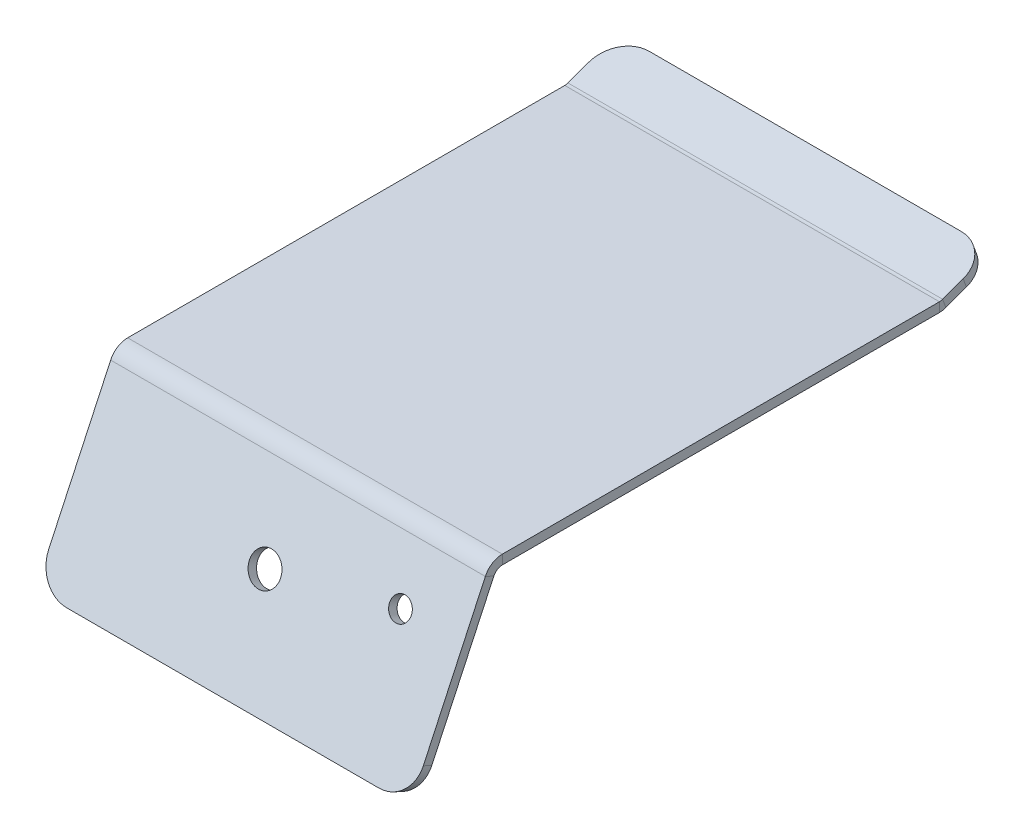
ISO-10303-21;
HEADER;
FILE_DESCRIPTION(('STEP AP214'),'2;1');
FILE_NAME('part.step','',(''),(''),'','','');
FILE_SCHEMA(('AUTOMOTIVE_DESIGN { 1 0 10303 214 1 1 1 1 }'));
ENDSEC;
DATA;
#1=APPLICATION_CONTEXT('core data for automotive mechanical design processes');
#2=APPLICATION_PROTOCOL_DEFINITION('international standard','automotive_design',2000,#1);
#3=PRODUCT_CONTEXT('',#1,'mechanical');
#4=PRODUCT('Part','Part','',(#3));
#5=PRODUCT_RELATED_PRODUCT_CATEGORY('part','',(#4));
#6=PRODUCT_DEFINITION_FORMATION('','',#4);
#7=PRODUCT_DEFINITION_CONTEXT('part definition',#1,'design');
#8=PRODUCT_DEFINITION('design','',#6,#7);
#9=PRODUCT_DEFINITION_SHAPE('','',#8);
#10=(LENGTH_UNIT() NAMED_UNIT(*) SI_UNIT(.MILLI.,.METRE.));
#11=(NAMED_UNIT(*) PLANE_ANGLE_UNIT() SI_UNIT($,.RADIAN.));
#12=(NAMED_UNIT(*) SI_UNIT($,.STERADIAN.) SOLID_ANGLE_UNIT());
#13=UNCERTAINTY_MEASURE_WITH_UNIT(LENGTH_MEASURE(1.E-05),#10,'distance_accuracy_value','');
#14=(GEOMETRIC_REPRESENTATION_CONTEXT(3) GLOBAL_UNCERTAINTY_ASSIGNED_CONTEXT((#13)) GLOBAL_UNIT_ASSIGNED_CONTEXT((#10,
#11,#12)) REPRESENTATION_CONTEXT('',''));
#15=CARTESIAN_POINT('',(0.,0.,0.));
#16=DIRECTION('',(0.,0.,1.));
#17=DIRECTION('',(1.,0.,0.));
#18=AXIS2_PLACEMENT_3D('',#15,#16,#17);
#19=CARTESIAN_POINT('',(60.,1.5,-5.00000000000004));
#20=DIRECTION('',(-1.,0.,0.));
#21=DIRECTION('',(0.,0.,1.));
#22=AXIS2_PLACEMENT_3D('',#19,#20,#21);
#23=PLANE('',#22);
#24=DIRECTION('',(0.,0.,-1.));
#25=VECTOR('',#24,1.);
#26=CARTESIAN_POINT('',(60.,1.5,-5.00000000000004));
#27=LINE('',#26,#25);
#28=CARTESIAN_POINT('',(60.,1.49999998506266,-30.));
#29=VERTEX_POINT('',#28);
#30=CARTESIAN_POINT('',(60.,1.5,-100.));
#31=VERTEX_POINT('',#30);
#32=EDGE_CURVE('E43',#29,#31,#27,.T.);
#33=ORIENTED_EDGE('',*,*,#32,.F.);
#34=DIRECTION('',(0.,-1.,0.));
#35=VECTOR('',#34,1.);
#36=CARTESIAN_POINT('',(60.,1.5,-30.));
#37=LINE('',#36,#35);
#38=CARTESIAN_POINT('',(60.,0.,-30.));
#39=VERTEX_POINT('',#38);
#40=EDGE_CURVE('E12',#29,#39,#37,.T.);
#41=ORIENTED_EDGE('',*,*,#40,.T.);
#42=DIRECTION('',(0.,0.,-1.));
#43=VECTOR('',#42,1.);
#44=CARTESIAN_POINT('',(60.,0.,-5.00000000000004));
#45=LINE('',#44,#43);
#46=CARTESIAN_POINT('',(60.,0.,-100.));
#47=VERTEX_POINT('',#46);
#48=EDGE_CURVE('E240',#39,#47,#45,.T.);
#49=ORIENTED_EDGE('',*,*,#48,.T.);
#50=DIRECTION('',(0.,-1.,0.));
#51=VECTOR('',#50,1.);
#52=CARTESIAN_POINT('',(60.,1.49999999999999,-100.));
#53=LINE('',#52,#51);
#54=EDGE_CURVE('E223',#31,#47,#53,.T.);
#55=ORIENTED_EDGE('',*,*,#54,.F.);
#56=EDGE_LOOP('',(#33,#41,#49,#55));
#57=FACE_BOUND('',#56,.T.);
#58=ADVANCED_FACE('F40',(#57),#23,.F.);
#59=CARTESIAN_POINT('',(55.,0.,-105.));
#60=DIRECTION('',(0.,1.,0.));
#61=DIRECTION('',(0.,0.,1.));
#62=AXIS2_PLACEMENT_3D('',#59,#60,#61);
#63=PLANE('',#62);
#64=ORIENTED_EDGE('',*,*,#48,.F.);
#65=DIRECTION('',(-1.,0.,0.));
#66=VECTOR('',#65,1.);
#67=CARTESIAN_POINT('',(55.,0.,-30.));
#68=LINE('',#67,#66);
#69=CARTESIAN_POINT('',(0.,-2.09997913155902E-08,-30.));
#70=VERTEX_POINT('',#69);
#71=EDGE_CURVE('E48',#39,#70,#68,.T.);
#72=ORIENTED_EDGE('',*,*,#71,.T.);
#73=DIRECTION('',(0.,0.,1.));
#74=VECTOR('',#73,1.);
#75=CARTESIAN_POINT('',(0.,0.,-5.00000000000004));
#76=LINE('',#75,#74);
#77=CARTESIAN_POINT('',(0.,0.,-100.));
#78=VERTEX_POINT('',#77);
#79=EDGE_CURVE('E288',#78,#70,#76,.T.);
#80=ORIENTED_EDGE('',*,*,#79,.F.);
#81=DIRECTION('',(-1.,0.,0.));
#82=VECTOR('',#81,1.);
#83=CARTESIAN_POINT('',(55.,0.,-100.));
#84=LINE('',#83,#82);
#85=EDGE_CURVE('E231',#47,#78,#84,.T.);
#86=ORIENTED_EDGE('',*,*,#85,.F.);
#87=EDGE_LOOP('',(#64,#72,#80,#86));
#88=FACE_BOUND('',#87,.T.);
#89=ADVANCED_FACE('F350',(#88),#63,.F.);
#90=CARTESIAN_POINT('',(0.,1.5,-5.00000000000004));
#91=DIRECTION('',(1.,0.,0.));
#92=DIRECTION('',(0.,0.,-1.));
#93=AXIS2_PLACEMENT_3D('',#90,#91,#92);
#94=PLANE('',#93);
#95=ORIENTED_EDGE('',*,*,#79,.T.);
#96=DIRECTION('',(0.,1.,0.));
#97=VECTOR('',#96,1.);
#98=CARTESIAN_POINT('',(0.,1.5,-30.));
#99=LINE('',#98,#97);
#100=CARTESIAN_POINT('',(0.,1.49999997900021,-30.));
#101=VERTEX_POINT('',#100);
#102=EDGE_CURVE('E282',#70,#101,#99,.T.);
#103=ORIENTED_EDGE('',*,*,#102,.T.);
#104=DIRECTION('',(0.,0.,1.));
#105=VECTOR('',#104,1.);
#106=CARTESIAN_POINT('',(0.,1.5,-5.00000000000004));
#107=LINE('',#106,#105);
#108=CARTESIAN_POINT('',(0.,1.49999993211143,-100.));
#109=VERTEX_POINT('',#108);
#110=EDGE_CURVE('E227',#109,#101,#107,.T.);
#111=ORIENTED_EDGE('',*,*,#110,.F.);
#112=DIRECTION('',(0.,1.,0.));
#113=VECTOR('',#112,1.);
#114=CARTESIAN_POINT('',(0.,1.49999999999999,-100.));
#115=LINE('',#114,#113);
#116=EDGE_CURVE('E228',#78,#109,#115,.T.);
#117=ORIENTED_EDGE('',*,*,#116,.F.);
#118=EDGE_LOOP('',(#95,#103,#111,#117));
#119=FACE_BOUND('',#118,.T.);
#120=ADVANCED_FACE('F298',(#119),#94,.F.);
#121=CARTESIAN_POINT('',(55.,1.37799263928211,-104.314984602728));
#122=DIRECTION('',(0.,0.939692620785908,0.342020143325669));
#123=DIRECTION('',(0.,-0.342020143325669,0.939692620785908));
#124=AXIS2_PLACEMENT_3D('',#121,#122,#123);
#125=PLANE('',#124);
#126=DIRECTION('',(0.,0.342020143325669,-0.939692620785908));
#127=VECTOR('',#126,1.);
#128=CARTESIAN_POINT('',(60.,-32.8240216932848,-10.3457225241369));
#129=LINE('',#128,#127);
#130=CARTESIAN_POINT('',(60.,0.180922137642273,-101.026060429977));
#131=VERTEX_POINT('',#130);
#132=CARTESIAN_POINT('',(60.,1.3779926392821,-104.314984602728));
#133=VERTEX_POINT('',#132);
#134=EDGE_CURVE('E64',#131,#133,#129,.T.);
#135=ORIENTED_EDGE('',*,*,#134,.F.);
#136=DIRECTION('',(-1.,0.,0.));
#137=VECTOR('',#136,1.);
#138=CARTESIAN_POINT('',(55.,0.180922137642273,-101.026060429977));
#139=LINE('',#138,#137);
#140=CARTESIAN_POINT('',(0.,0.180922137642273,-101.026060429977));
#141=VERTEX_POINT('',#140);
#142=EDGE_CURVE('E271',#131,#141,#139,.T.);
#143=ORIENTED_EDGE('',*,*,#142,.T.);
#144=DIRECTION('',(0.,-0.342020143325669,0.939692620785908));
#145=VECTOR('',#144,1.);
#146=CARTESIAN_POINT('',(0.,-32.8240216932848,-10.3457225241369));
#147=LINE('',#146,#145);
#148=CARTESIAN_POINT('',(0.,1.3779926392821,-104.314984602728));
#149=VERTEX_POINT('',#148);
#150=EDGE_CURVE('E244',#149,#141,#147,.T.);
#151=ORIENTED_EDGE('',*,*,#150,.F.);
#152=CARTESIAN_POINT('',(5.,1.37799263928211,-104.314984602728));
#153=DIRECTION('',(0.,0.939692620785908,0.342020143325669));
#154=DIRECTION('',(0.,-0.342020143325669,0.939692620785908));
#155=AXIS2_PLACEMENT_3D('',#152,#153,#154);
#156=CIRCLE('',#155,5.);
#157=CARTESIAN_POINT('',(5.00000000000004,3.08809335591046,-109.013447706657));
#158=VERTEX_POINT('',#157);
#159=EDGE_CURVE('E242',#158,#149,#156,.T.);
#160=ORIENTED_EDGE('',*,*,#159,.F.);
#161=DIRECTION('',(-1.,0.,0.));
#162=VECTOR('',#161,1.);
#163=CARTESIAN_POINT('',(5.00000000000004,3.08809335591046,-109.013447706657));
#164=LINE('',#163,#162);
#165=CARTESIAN_POINT('',(55.,3.08809335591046,-109.013447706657));
#166=VERTEX_POINT('',#165);
#167=EDGE_CURVE('E239',#166,#158,#164,.T.);
#168=ORIENTED_EDGE('',*,*,#167,.F.);
#169=CARTESIAN_POINT('',(55.,1.37799263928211,-104.314984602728));
#170=DIRECTION('',(0.,0.939692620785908,0.342020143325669));
#171=DIRECTION('',(0.,-0.342020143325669,0.939692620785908));
#172=AXIS2_PLACEMENT_3D('',#169,#170,#171);
#173=CIRCLE('',#172,5.);
#174=EDGE_CURVE('E236',#133,#166,#173,.T.);
#175=ORIENTED_EDGE('',*,*,#174,.F.);
#176=EDGE_LOOP('',(#135,#143,#151,#160,#168,#175));
#177=FACE_BOUND('',#176,.T.);
#178=ADVANCED_FACE('F374',(#177),#125,.F.);
#179=CARTESIAN_POINT('',(0.,-31.414482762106,-9.83269230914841));
#180=DIRECTION('',(1.,0.,0.));
#181=DIRECTION('',(0.,0.342020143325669,-0.939692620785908));
#182=AXIS2_PLACEMENT_3D('',#179,#180,#181);
#183=PLANE('',#182);
#184=ORIENTED_EDGE('',*,*,#150,.T.);
#185=DIRECTION('',(0.,0.939692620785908,0.342020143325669));
#186=VECTOR('',#185,1.);
#187=CARTESIAN_POINT('',(0.,1.59046106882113,-100.513030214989));
#188=LINE('',#187,#186);
#189=CARTESIAN_POINT('',(0.,1.59046100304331,-100.51303023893));
#190=VERTEX_POINT('',#189);
#191=EDGE_CURVE('E269',#141,#190,#188,.T.);
#192=ORIENTED_EDGE('',*,*,#191,.T.);
#193=DIRECTION('',(0.,-0.342020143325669,0.939692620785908));
#194=VECTOR('',#193,1.);
#195=CARTESIAN_POINT('',(0.,-31.414482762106,-9.83269230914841));
#196=LINE('',#195,#194);
#197=CARTESIAN_POINT('',(0.,2.78753157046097,-103.801954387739));
#198=VERTEX_POINT('',#197);
#199=EDGE_CURVE('E252',#198,#190,#196,.T.);
#200=ORIENTED_EDGE('',*,*,#199,.F.);
#201=DIRECTION('',(0.,-0.939692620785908,-0.342020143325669));
#202=VECTOR('',#201,1.);
#203=CARTESIAN_POINT('',(0.,2.78753157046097,-103.801954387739));
#204=LINE('',#203,#202);
#205=EDGE_CURVE('E256',#198,#149,#204,.T.);
#206=ORIENTED_EDGE('',*,*,#205,.T.);
#207=EDGE_LOOP('',(#184,#192,#200,#206));
#208=FACE_BOUND('',#207,.T.);
#209=ADVANCED_FACE('F377',(#208),#183,.F.);
#210=CARTESIAN_POINT('',(60.,-31.414482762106,-9.83269230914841));
#211=DIRECTION('',(-1.,0.,0.));
#212=DIRECTION('',(0.,-0.342020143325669,0.939692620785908));
#213=AXIS2_PLACEMENT_3D('',#210,#211,#212);
#214=PLANE('',#213);
#215=DIRECTION('',(0.,0.342020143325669,-0.939692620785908));
#216=VECTOR('',#215,1.);
#217=CARTESIAN_POINT('',(60.,-31.414482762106,-9.83269230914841));
#218=LINE('',#217,#216);
#219=CARTESIAN_POINT('',(60.,1.59046106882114,-100.513030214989));
#220=VERTEX_POINT('',#219);
#221=CARTESIAN_POINT('',(60.,2.78753157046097,-103.801954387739));
#222=VERTEX_POINT('',#221);
#223=EDGE_CURVE('E257',#220,#222,#218,.T.);
#224=ORIENTED_EDGE('',*,*,#223,.F.);
#225=DIRECTION('',(0.,-0.939692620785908,-0.342020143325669));
#226=VECTOR('',#225,1.);
#227=CARTESIAN_POINT('',(60.,1.59046106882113,-100.513030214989));
#228=LINE('',#227,#226);
#229=EDGE_CURVE('E273',#220,#131,#228,.T.);
#230=ORIENTED_EDGE('',*,*,#229,.T.);
#231=ORIENTED_EDGE('',*,*,#134,.T.);
#232=DIRECTION('',(0.,-0.939692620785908,-0.342020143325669));
#233=VECTOR('',#232,1.);
#234=CARTESIAN_POINT('',(60.,2.78753157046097,-103.801954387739));
#235=LINE('',#234,#233);
#236=EDGE_CURVE('E253',#222,#133,#235,.T.);
#237=ORIENTED_EDGE('',*,*,#236,.F.);
#238=EDGE_LOOP('',(#224,#230,#231,#237));
#239=FACE_BOUND('',#238,.T.);
#240=ADVANCED_FACE('F393',(#239),#214,.F.);
#241=CARTESIAN_POINT('',(55.,2.78753157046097,-103.801954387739));
#242=DIRECTION('',(0.,0.939692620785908,0.342020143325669));
#243=DIRECTION('',(0.,-0.342020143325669,0.939692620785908));
#244=AXIS2_PLACEMENT_3D('',#241,#242,#243);
#245=PLANE('',#244);
#246=DIRECTION('',(-1.,0.,0.));
#247=VECTOR('',#246,1.);
#248=CARTESIAN_POINT('',(55.,1.59046106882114,-100.513030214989));
#249=LINE('',#248,#247);
#250=EDGE_CURVE('E266',#220,#190,#249,.T.);
#251=ORIENTED_EDGE('',*,*,#250,.F.);
#252=ORIENTED_EDGE('',*,*,#223,.T.);
#253=CARTESIAN_POINT('',(55.,2.78753157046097,-103.801954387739));
#254=DIRECTION('',(0.,0.939692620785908,0.342020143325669));
#255=DIRECTION('',(0.,-0.342020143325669,0.939692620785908));
#256=AXIS2_PLACEMENT_3D('',#253,#254,#255);
#257=CIRCLE('',#256,5.);
#258=CARTESIAN_POINT('',(55.,4.49763228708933,-108.500417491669));
#259=VERTEX_POINT('',#258);
#260=EDGE_CURVE('E245',#222,#259,#257,.T.);
#261=ORIENTED_EDGE('',*,*,#260,.T.);
#262=DIRECTION('',(-1.,0.,0.));
#263=VECTOR('',#262,1.);
#264=CARTESIAN_POINT('',(5.00000000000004,4.49763228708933,-108.500417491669));
#265=LINE('',#264,#263);
#266=CARTESIAN_POINT('',(5.00000000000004,4.49763228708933,-108.500417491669));
#267=VERTEX_POINT('',#266);
#268=EDGE_CURVE('E248',#259,#267,#265,.T.);
#269=ORIENTED_EDGE('',*,*,#268,.T.);
#270=CARTESIAN_POINT('',(5.,2.78753157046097,-103.801954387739));
#271=DIRECTION('',(0.,0.939692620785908,0.342020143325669));
#272=DIRECTION('',(0.,-0.342020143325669,0.939692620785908));
#273=AXIS2_PLACEMENT_3D('',#270,#271,#272);
#274=CIRCLE('',#273,5.);
#275=EDGE_CURVE('E250',#267,#198,#274,.T.);
#276=ORIENTED_EDGE('',*,*,#275,.T.);
#277=ORIENTED_EDGE('',*,*,#199,.T.);
#278=EDGE_LOOP('',(#251,#252,#261,#269,#276,#277));
#279=FACE_BOUND('',#278,.T.);
#280=ADVANCED_FACE('F395',(#279),#245,.T.);
#281=CARTESIAN_POINT('',(55.,2.78753157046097,-103.801954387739));
#282=DIRECTION('',(0.,-0.939692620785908,-0.342020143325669));
#283=DIRECTION('',(0.,0.342020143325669,-0.939692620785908));
#284=AXIS2_PLACEMENT_3D('',#281,#282,#283);
#285=CYLINDRICAL_SURFACE('',#284,5.);
#286=ORIENTED_EDGE('',*,*,#174,.T.);
#287=DIRECTION('',(0.,-0.939692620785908,-0.342020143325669));
#288=VECTOR('',#287,1.);
#289=CARTESIAN_POINT('',(55.,4.49763228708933,-108.500417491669));
#290=LINE('',#289,#288);
#291=EDGE_CURVE('E263',#259,#166,#290,.T.);
#292=ORIENTED_EDGE('',*,*,#291,.F.);
#293=ORIENTED_EDGE('',*,*,#260,.F.);
#294=ORIENTED_EDGE('',*,*,#236,.T.);
#295=EDGE_LOOP('',(#286,#292,#293,#294));
#296=FACE_BOUND('',#295,.T.);
#297=ADVANCED_FACE('F388',(#296),#285,.T.);
#298=CARTESIAN_POINT('',(5.00000000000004,4.49763228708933,-108.500417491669));
#299=DIRECTION('',(0.,-0.342020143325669,0.939692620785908));
#300=DIRECTION('',(1.,0.,0.));
#301=AXIS2_PLACEMENT_3D('',#298,#299,#300);
#302=PLANE('',#301);
#303=ORIENTED_EDGE('',*,*,#167,.T.);
#304=DIRECTION('',(0.,-0.939692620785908,-0.342020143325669));
#305=VECTOR('',#304,1.);
#306=CARTESIAN_POINT('',(5.00000000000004,4.49763228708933,-108.500417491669));
#307=LINE('',#306,#305);
#308=EDGE_CURVE('E260',#267,#158,#307,.T.);
#309=ORIENTED_EDGE('',*,*,#308,.F.);
#310=ORIENTED_EDGE('',*,*,#268,.F.);
#311=ORIENTED_EDGE('',*,*,#291,.T.);
#312=EDGE_LOOP('',(#303,#309,#310,#311));
#313=FACE_BOUND('',#312,.T.);
#314=ADVANCED_FACE('F385',(#313),#302,.F.);
#315=CARTESIAN_POINT('',(5.,2.78753157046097,-103.801954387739));
#316=DIRECTION('',(0.,-0.939692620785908,-0.342020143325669));
#317=DIRECTION('',(0.,0.342020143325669,-0.939692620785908));
#318=AXIS2_PLACEMENT_3D('',#315,#316,#317);
#319=CYLINDRICAL_SURFACE('',#318,5.);
#320=ORIENTED_EDGE('',*,*,#159,.T.);
#321=ORIENTED_EDGE('',*,*,#205,.F.);
#322=ORIENTED_EDGE('',*,*,#275,.F.);
#323=ORIENTED_EDGE('',*,*,#308,.T.);
#324=EDGE_LOOP('',(#320,#321,#322,#323));
#325=FACE_BOUND('',#324,.T.);
#326=ADVANCED_FACE('F382',(#325),#319,.T.);
#327=CARTESIAN_POINT('',(55.,1.5,-105.));
#328=DIRECTION('',(0.,1.,0.));
#329=DIRECTION('',(0.,0.,1.));
#330=AXIS2_PLACEMENT_3D('',#327,#328,#329);
#331=PLANE('',#330);
#332=DIRECTION('',(-1.,0.,0.));
#333=VECTOR('',#332,1.);
#334=CARTESIAN_POINT('',(55.,1.5,-30.));
#335=LINE('',#334,#333);
#336=EDGE_CURVE('E275',#29,#101,#335,.T.);
#337=ORIENTED_EDGE('',*,*,#336,.F.);
#338=ORIENTED_EDGE('',*,*,#32,.T.);
#339=DIRECTION('',(-1.,0.,0.));
#340=VECTOR('',#339,1.);
#341=CARTESIAN_POINT('',(55.,1.5,-100.));
#342=LINE('',#341,#340);
#343=EDGE_CURVE('E224',#31,#109,#342,.T.);
#344=ORIENTED_EDGE('',*,*,#343,.T.);
#345=ORIENTED_EDGE('',*,*,#110,.T.);
#346=EDGE_LOOP('',(#337,#338,#344,#345));
#347=FACE_BOUND('',#346,.T.);
#348=ADVANCED_FACE('F293',(#347),#331,.T.);
#349=CARTESIAN_POINT('',(60.,3.0000000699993,-100.));
#350=DIRECTION('',(-1.,0.,0.));
#351=DIRECTION('',(0.,0.,1.));
#352=AXIS2_PLACEMENT_3D('',#349,#350,#351);
#353=PLANE('',#352);
#354=ORIENTED_EDGE('',*,*,#54,.T.);
#355=CARTESIAN_POINT('',(60.,3.,-100.));
#356=DIRECTION('',(-1.,0.,0.));
#357=DIRECTION('',(0.,0.,1.));
#358=AXIS2_PLACEMENT_3D('',#355,#356,#357);
#359=CIRCLE('',#358,3.0000000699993);
#360=EDGE_CURVE('E211',#47,#131,#359,.F.);
#361=ORIENTED_EDGE('',*,*,#360,.T.);
#362=ORIENTED_EDGE('',*,*,#229,.F.);
#363=CARTESIAN_POINT('',(60.,3.0000000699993,-100.));
#364=DIRECTION('',(1.,0.,0.));
#365=DIRECTION('',(0.,0.,-1.));
#366=AXIS2_PLACEMENT_3D('',#363,#364,#365);
#367=CIRCLE('',#366,1.50000013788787);
#368=EDGE_CURVE('E215',#31,#220,#367,.T.);
#369=ORIENTED_EDGE('',*,*,#368,.F.);
#370=EDGE_LOOP('',(#354,#361,#362,#369));
#371=FACE_BOUND('',#370,.T.);
#372=ADVANCED_FACE('F362',(#371),#353,.F.);
#373=CARTESIAN_POINT('',(0.,3.0000000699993,-100.));
#374=DIRECTION('',(1.,0.,0.));
#375=DIRECTION('',(0.,0.,-1.));
#376=AXIS2_PLACEMENT_3D('',#373,#374,#375);
#377=PLANE('',#376);
#378=ORIENTED_EDGE('',*,*,#191,.F.);
#379=CARTESIAN_POINT('',(0.,3.,-100.));
#380=DIRECTION('',(-1.,0.,0.));
#381=DIRECTION('',(0.,0.,1.));
#382=AXIS2_PLACEMENT_3D('',#379,#380,#381);
#383=CIRCLE('',#382,3.0000000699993);
#384=EDGE_CURVE('E212',#141,#78,#383,.T.);
#385=ORIENTED_EDGE('',*,*,#384,.T.);
#386=ORIENTED_EDGE('',*,*,#116,.T.);
#387=CARTESIAN_POINT('',(0.,3.0000000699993,-100.));
#388=DIRECTION('',(-1.,0.,0.));
#389=DIRECTION('',(0.,0.,1.));
#390=AXIS2_PLACEMENT_3D('',#387,#388,#389);
#391=CIRCLE('',#390,1.50000013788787);
#392=EDGE_CURVE('E220',#190,#109,#391,.T.);
#393=ORIENTED_EDGE('',*,*,#392,.F.);
#394=EDGE_LOOP('',(#378,#385,#386,#393));
#395=FACE_BOUND('',#394,.T.);
#396=ADVANCED_FACE('F368',(#395),#377,.F.);
#397=CARTESIAN_POINT('',(90.0374882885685,3.,-100.));
#398=DIRECTION('',(-1.,0.,0.));
#399=DIRECTION('',(0.,0.,1.));
#400=AXIS2_PLACEMENT_3D('',#397,#398,#399);
#401=CYLINDRICAL_SURFACE('',#400,1.5000000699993);
#402=ORIENTED_EDGE('',*,*,#392,.T.);
#403=ORIENTED_EDGE('',*,*,#343,.F.);
#404=ORIENTED_EDGE('',*,*,#368,.T.);
#405=ORIENTED_EDGE('',*,*,#250,.T.);
#406=EDGE_LOOP('',(#402,#403,#404,#405));
#407=FACE_BOUND('',#406,.T.);
#408=ADVANCED_FACE('F364',(#407),#401,.F.);
#409=CARTESIAN_POINT('',(90.0374882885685,3.,-100.));
#410=DIRECTION('',(-1.,0.,0.));
#411=DIRECTION('',(0.,0.,1.));
#412=AXIS2_PLACEMENT_3D('',#409,#410,#411);
#413=CYLINDRICAL_SURFACE('',#412,3.0000000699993);
#414=ORIENTED_EDGE('',*,*,#384,.F.);
#415=ORIENTED_EDGE('',*,*,#142,.F.);
#416=ORIENTED_EDGE('',*,*,#360,.F.);
#417=ORIENTED_EDGE('',*,*,#85,.T.);
#418=EDGE_LOOP('',(#414,#415,#416,#417));
#419=FACE_BOUND('',#418,.T.);
#420=ADVANCED_FACE('F372',(#419),#413,.T.);
#421=CARTESIAN_POINT('',(60.,-1.49999997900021,-30.));
#422=DIRECTION('',(1.,0.,0.));
#423=DIRECTION('',(0.,0.,-1.));
#424=AXIS2_PLACEMENT_3D('',#421,#422,#423);
#425=PLANE('',#424);
#426=DIRECTION('',(0.,-0.422618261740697,-0.906307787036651));
#427=VECTOR('',#426,1.);
#428=CARTESIAN_POINT('',(60.,-0.23214521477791,-27.28107663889));
#429=LINE('',#428,#427);
#430=CARTESIAN_POINT('',(60.,-0.232145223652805,-27.2810766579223));
#431=VERTEX_POINT('',#430);
#432=CARTESIAN_POINT('',(60.,-0.866072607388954,-28.640538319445));
#433=VERTEX_POINT('',#432);
#434=EDGE_CURVE('E198',#431,#433,#429,.T.);
#435=ORIENTED_EDGE('',*,*,#434,.T.);
#436=CARTESIAN_POINT('',(60.,-1.5,-30.));
#437=DIRECTION('',(1.,0.,0.));
#438=DIRECTION('',(0.,0.,-1.));
#439=AXIS2_PLACEMENT_3D('',#436,#437,#438);
#440=CIRCLE('',#439,1.49999997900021);
#441=EDGE_CURVE('E56',#433,#39,#440,.F.);
#442=ORIENTED_EDGE('',*,*,#441,.T.);
#443=ORIENTED_EDGE('',*,*,#40,.F.);
#444=CARTESIAN_POINT('',(60.,-1.49999997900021,-30.));
#445=DIRECTION('',(-1.,0.,0.));
#446=DIRECTION('',(0.,0.,1.));
#447=AXIS2_PLACEMENT_3D('',#444,#445,#446);
#448=CIRCLE('',#447,2.99999996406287);
#449=EDGE_CURVE('E205',#431,#29,#448,.T.);
#450=ORIENTED_EDGE('',*,*,#449,.F.);
#451=EDGE_LOOP('',(#435,#442,#443,#450));
#452=FACE_BOUND('',#451,.T.);
#453=ADVANCED_FACE('F308',(#452),#425,.T.);
#454=CARTESIAN_POINT('',(0.,-1.49999997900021,-30.));
#455=DIRECTION('',(-1.,0.,0.));
#456=DIRECTION('',(0.,0.,1.));
#457=AXIS2_PLACEMENT_3D('',#454,#455,#456);
#458=PLANE('',#457);
#459=CARTESIAN_POINT('',(0.,-1.5,-30.));
#460=DIRECTION('',(1.,0.,0.));
#461=DIRECTION('',(0.,0.,-1.));
#462=AXIS2_PLACEMENT_3D('',#459,#460,#461);
#463=CIRCLE('',#462,1.49999997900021);
#464=CARTESIAN_POINT('',(0.,-0.866072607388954,-28.640538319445));
#465=VERTEX_POINT('',#464);
#466=EDGE_CURVE('E201',#70,#465,#463,.T.);
#467=ORIENTED_EDGE('',*,*,#466,.T.);
#468=DIRECTION('',(0.,0.422618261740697,0.906307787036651));
#469=VECTOR('',#468,1.);
#470=CARTESIAN_POINT('',(0.,-0.23214521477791,-27.28107663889));
#471=LINE('',#470,#469);
#472=CARTESIAN_POINT('',(0.,-0.232145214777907,-27.28107663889));
#473=VERTEX_POINT('',#472);
#474=EDGE_CURVE('E163',#465,#473,#471,.T.);
#475=ORIENTED_EDGE('',*,*,#474,.T.);
#476=CARTESIAN_POINT('',(0.,-1.49999997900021,-30.));
#477=DIRECTION('',(1.,0.,0.));
#478=DIRECTION('',(0.,0.,-1.));
#479=AXIS2_PLACEMENT_3D('',#476,#477,#478);
#480=CIRCLE('',#479,2.99999996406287);
#481=EDGE_CURVE('E208',#101,#473,#480,.T.);
#482=ORIENTED_EDGE('',*,*,#481,.F.);
#483=ORIENTED_EDGE('',*,*,#102,.F.);
#484=EDGE_LOOP('',(#467,#475,#482,#483));
#485=FACE_BOUND('',#484,.T.);
#486=ADVANCED_FACE('F302',(#485),#458,.T.);
#487=CARTESIAN_POINT('',(-30.0374882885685,-1.5,-30.));
#488=DIRECTION('',(1.,0.,0.));
#489=DIRECTION('',(0.,0.,-1.));
#490=AXIS2_PLACEMENT_3D('',#487,#488,#489);
#491=CYLINDRICAL_SURFACE('',#490,2.99999997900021);
#492=ORIENTED_EDGE('',*,*,#336,.T.);
#493=ORIENTED_EDGE('',*,*,#481,.T.);
#494=DIRECTION('',(-1.,0.,0.));
#495=VECTOR('',#494,1.);
#496=CARTESIAN_POINT('',(55.,-0.232145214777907,-27.28107663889));
#497=LINE('',#496,#495);
#498=EDGE_CURVE('E318',#431,#473,#497,.T.);
#499=ORIENTED_EDGE('',*,*,#498,.F.);
#500=ORIENTED_EDGE('',*,*,#449,.T.);
#501=EDGE_LOOP('',(#492,#493,#499,#500));
#502=FACE_BOUND('',#501,.T.);
#503=ADVANCED_FACE('F324',(#502),#491,.T.);
#504=CARTESIAN_POINT('',(-30.0374882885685,-1.5,-30.));
#505=DIRECTION('',(1.,0.,0.));
#506=DIRECTION('',(0.,0.,-1.));
#507=AXIS2_PLACEMENT_3D('',#504,#505,#506);
#508=CYLINDRICAL_SURFACE('',#507,1.49999997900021);
#509=ORIENTED_EDGE('',*,*,#71,.F.);
#510=ORIENTED_EDGE('',*,*,#441,.F.);
#511=DIRECTION('',(-1.,0.,0.));
#512=VECTOR('',#511,1.);
#513=CARTESIAN_POINT('',(55.,-0.866072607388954,-28.640538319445));
#514=LINE('',#513,#512);
#515=EDGE_CURVE('E196',#433,#465,#514,.T.);
#516=ORIENTED_EDGE('',*,*,#515,.T.);
#517=ORIENTED_EDGE('',*,*,#466,.F.);
#518=EDGE_LOOP('',(#509,#510,#516,#517));
#519=FACE_BOUND('',#518,.T.);
#520=ADVANCED_FACE('F304',(#519),#508,.F.);
#521=CARTESIAN_POINT('',(55.,-21.5303782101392,-17.3495474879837));
#522=DIRECTION('',(0.,-0.422618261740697,-0.906307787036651));
#523=DIRECTION('',(0.,0.906307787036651,-0.422618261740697));
#524=AXIS2_PLACEMENT_3D('',#521,#522,#523);
#525=CYLINDRICAL_SURFACE('',#524,5.);
#526=CARTESIAN_POINT('',(55.,-22.1643056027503,-18.7090091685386));
#527=DIRECTION('',(0.,0.422618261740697,0.906307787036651));
#528=DIRECTION('',(0.,-0.906307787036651,0.422618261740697));
#529=AXIS2_PLACEMENT_3D('',#526,#527,#528);
#530=CIRCLE('',#529,5.);
#531=CARTESIAN_POINT('',(55.,-26.6958445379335,-16.5959178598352));
#532=VERTEX_POINT('',#531);
#533=CARTESIAN_POINT('',(60.,-22.1643056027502,-18.7090091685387));
#534=VERTEX_POINT('',#533);
#535=EDGE_CURVE('E193',#532,#534,#530,.T.);
#536=ORIENTED_EDGE('',*,*,#535,.T.);
#537=DIRECTION('',(0.,-0.422618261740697,-0.906307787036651));
#538=VECTOR('',#537,1.);
#539=CARTESIAN_POINT('',(60.,-21.5303782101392,-17.3495474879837));
#540=LINE('',#539,#538);
#541=CARTESIAN_POINT('',(60.,-21.5303782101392,-17.3495474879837));
#542=VERTEX_POINT('',#541);
#543=EDGE_CURVE('E634',#542,#534,#540,.T.);
#544=ORIENTED_EDGE('',*,*,#543,.F.);
#545=CARTESIAN_POINT('',(55.,-21.5303782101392,-17.3495474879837));
#546=DIRECTION('',(0.,0.422618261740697,0.906307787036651));
#547=DIRECTION('',(0.,-0.906307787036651,0.422618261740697));
#548=AXIS2_PLACEMENT_3D('',#545,#546,#547);
#549=CIRCLE('',#548,5.);
#550=CARTESIAN_POINT('',(55.,-26.0619171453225,-15.2364561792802));
#551=VERTEX_POINT('',#550);
#552=EDGE_CURVE('E169',#551,#542,#549,.T.);
#553=ORIENTED_EDGE('',*,*,#552,.F.);
#554=DIRECTION('',(0.,-0.422618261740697,-0.906307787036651));
#555=VECTOR('',#554,1.);
#556=CARTESIAN_POINT('',(55.,-26.0619171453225,-15.2364561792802));
#557=LINE('',#556,#555);
#558=EDGE_CURVE('E190',#551,#532,#557,.T.);
#559=ORIENTED_EDGE('',*,*,#558,.T.);
#560=EDGE_LOOP('',(#536,#544,#553,#559));
#561=FACE_BOUND('',#560,.T.);
#562=ADVANCED_FACE('F548',(#561),#525,.T.);
#563=CARTESIAN_POINT('',(5.00000000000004,-26.0619171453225,-15.2364561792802));
#564=DIRECTION('',(0.,0.906307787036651,-0.422618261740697));
#565=DIRECTION('',(-1.,0.,0.));
#566=AXIS2_PLACEMENT_3D('',#563,#564,#565);
#567=PLANE('',#566);
#568=DIRECTION('',(1.,0.,0.));
#569=VECTOR('',#568,1.);
#570=CARTESIAN_POINT('',(5.00000000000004,-26.6958445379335,-16.5959178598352));
#571=LINE('',#570,#569);
#572=CARTESIAN_POINT('',(5.00000000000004,-26.6958445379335,-16.5959178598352));
#573=VERTEX_POINT('',#572);
#574=EDGE_CURVE('E183',#573,#532,#571,.T.);
#575=ORIENTED_EDGE('',*,*,#574,.T.);
#576=ORIENTED_EDGE('',*,*,#558,.F.);
#577=DIRECTION('',(1.,0.,0.));
#578=VECTOR('',#577,1.);
#579=CARTESIAN_POINT('',(5.00000000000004,-26.0619171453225,-15.2364561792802));
#580=LINE('',#579,#578);
#581=CARTESIAN_POINT('',(5.00000000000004,-26.0619171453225,-15.2364561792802));
#582=VERTEX_POINT('',#581);
#583=EDGE_CURVE('E645',#582,#551,#580,.T.);
#584=ORIENTED_EDGE('',*,*,#583,.F.);
#585=DIRECTION('',(0.,-0.422618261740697,-0.906307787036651));
#586=VECTOR('',#585,1.);
#587=CARTESIAN_POINT('',(5.00000000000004,-26.0619171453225,-15.2364561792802));
#588=LINE('',#587,#586);
#589=EDGE_CURVE('E184',#582,#573,#588,.T.);
#590=ORIENTED_EDGE('',*,*,#589,.T.);
#591=EDGE_LOOP('',(#575,#576,#584,#590));
#592=FACE_BOUND('',#591,.T.);
#593=ADVANCED_FACE('F602',(#592),#567,.F.);
#594=CARTESIAN_POINT('',(5.,-21.5303782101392,-17.3495474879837));
#595=DIRECTION('',(0.,-0.422618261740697,-0.906307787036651));
#596=DIRECTION('',(0.,0.906307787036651,-0.422618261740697));
#597=AXIS2_PLACEMENT_3D('',#594,#595,#596);
#598=CYLINDRICAL_SURFACE('',#597,5.);
#599=CARTESIAN_POINT('',(5.,-22.1643056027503,-18.7090091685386));
#600=DIRECTION('',(0.,0.422618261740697,0.906307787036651));
#601=DIRECTION('',(0.,-0.906307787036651,0.422618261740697));
#602=AXIS2_PLACEMENT_3D('',#599,#600,#601);
#603=CIRCLE('',#602,5.);
#604=CARTESIAN_POINT('',(0.,-22.1643056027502,-18.7090091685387));
#605=VERTEX_POINT('',#604);
#606=EDGE_CURVE('E174',#605,#573,#603,.T.);
#607=ORIENTED_EDGE('',*,*,#606,.T.);
#608=ORIENTED_EDGE('',*,*,#589,.F.);
#609=CARTESIAN_POINT('',(5.,-21.5303782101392,-17.3495474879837));
#610=DIRECTION('',(0.,0.422618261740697,0.906307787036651));
#611=DIRECTION('',(0.,-0.906307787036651,0.422618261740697));
#612=AXIS2_PLACEMENT_3D('',#609,#610,#611);
#613=CIRCLE('',#612,5.);
#614=CARTESIAN_POINT('',(0.,-21.5303782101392,-17.3495474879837));
#615=VERTEX_POINT('',#614);
#616=EDGE_CURVE('E176',#615,#582,#613,.T.);
#617=ORIENTED_EDGE('',*,*,#616,.F.);
#618=DIRECTION('',(0.,-0.422618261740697,-0.906307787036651));
#619=VECTOR('',#618,1.);
#620=CARTESIAN_POINT('',(0.,-21.5303782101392,-17.3495474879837));
#621=LINE('',#620,#619);
#622=EDGE_CURVE('E160',#615,#605,#621,.T.);
#623=ORIENTED_EDGE('',*,*,#622,.T.);
#624=EDGE_LOOP('',(#607,#608,#617,#623));
#625=FACE_BOUND('',#624,.T.);
#626=ADVANCED_FACE('F172',(#625),#598,.T.);
#627=CARTESIAN_POINT('',(30.,-11.560992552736,-21.9983483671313));
#628=DIRECTION('',(0.,-0.422618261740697,-0.906307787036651));
#629=DIRECTION('',(0.,0.906307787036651,-0.422618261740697));
#630=AXIS2_PLACEMENT_3D('',#627,#628,#629);
#631=CYLINDRICAL_SURFACE('',#630,2.5);
#632=CARTESIAN_POINT('',(30.,-11.560992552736,-21.9983483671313));
#633=DIRECTION('',(0.,0.422618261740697,0.906307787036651));
#634=DIRECTION('',(0.,-0.906307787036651,0.422618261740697));
#635=AXIS2_PLACEMENT_3D('',#632,#633,#634);
#636=CIRCLE('',#635,2.5);
#637=CARTESIAN_POINT('',(30.,-13.8267620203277,-20.9418027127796));
#638=VERTEX_POINT('',#637);
#639=EDGE_CURVE('E177',#638,#638,#636,.T.);
#640=ORIENTED_EDGE('',*,*,#639,.T.);
#641=EDGE_LOOP('',(#640));
#642=FACE_BOUND('',#641,.T.);
#643=CARTESIAN_POINT('',(30.,-12.1949199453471,-23.3578100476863));
#644=DIRECTION('',(0.,0.422618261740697,0.906307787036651));
#645=DIRECTION('',(0.,-0.906307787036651,0.422618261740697));
#646=AXIS2_PLACEMENT_3D('',#643,#644,#645);
#647=CIRCLE('',#646,2.5);
#648=CARTESIAN_POINT('',(30.,-14.4606894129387,-22.3012643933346));
#649=VERTEX_POINT('',#648);
#650=EDGE_CURVE('E168',#649,#649,#647,.T.);
#651=ORIENTED_EDGE('',*,*,#650,.F.);
#652=EDGE_LOOP('',(#651));
#653=FACE_BOUND('',#652,.T.);
#654=ADVANCED_FACE('F334',(#642,#653),#631,.F.);
#655=CARTESIAN_POINT('',(50.,-7.93576140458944,-23.6888214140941));
#656=DIRECTION('',(0.,-0.422618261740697,-0.906307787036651));
#657=DIRECTION('',(0.,0.906307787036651,-0.422618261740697));
#658=AXIS2_PLACEMENT_3D('',#655,#656,#657);
#659=CYLINDRICAL_SURFACE('',#658,1.75);
#660=CARTESIAN_POINT('',(50.,-7.93576140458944,-23.6888214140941));
#661=DIRECTION('',(0.,0.422618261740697,0.906307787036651));
#662=DIRECTION('',(0.,-0.906307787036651,0.422618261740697));
#663=AXIS2_PLACEMENT_3D('',#660,#661,#662);
#664=CIRCLE('',#663,1.75);
#665=CARTESIAN_POINT('',(50.,-9.52180003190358,-22.9492394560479));
#666=VERTEX_POINT('',#665);
#667=EDGE_CURVE('E321',#666,#666,#664,.T.);
#668=ORIENTED_EDGE('',*,*,#667,.T.);
#669=EDGE_LOOP('',(#668));
#670=FACE_BOUND('',#669,.T.);
#671=CARTESIAN_POINT('',(50.,-8.56968879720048,-25.0482830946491));
#672=DIRECTION('',(0.,0.422618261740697,0.906307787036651));
#673=DIRECTION('',(0.,-0.906307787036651,0.422618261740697));
#674=AXIS2_PLACEMENT_3D('',#671,#672,#673);
#675=CIRCLE('',#674,1.75);
#676=CARTESIAN_POINT('',(50.,-10.1557274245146,-24.3087011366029));
#677=VERTEX_POINT('',#676);
#678=EDGE_CURVE('E636',#677,#677,#675,.T.);
#679=ORIENTED_EDGE('',*,*,#678,.F.);
#680=EDGE_LOOP('',(#679));
#681=FACE_BOUND('',#680,.T.);
#682=ADVANCED_FACE('F338',(#670,#681),#659,.F.);
#683=CARTESIAN_POINT('',(55.,69.1004004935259,-59.6113736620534));
#684=DIRECTION('',(0.,0.422618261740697,0.906307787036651));
#685=DIRECTION('',(0.,-0.906307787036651,0.422618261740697));
#686=AXIS2_PLACEMENT_3D('',#683,#684,#685);
#687=PLANE('',#686);
#688=ORIENTED_EDGE('',*,*,#667,.F.);
#689=EDGE_LOOP('',(#688));
#690=FACE_BOUND('',#689,.T.);
#691=ORIENTED_EDGE('',*,*,#639,.F.);
#692=EDGE_LOOP('',(#691));
#693=FACE_BOUND('',#692,.T.);
#694=DIRECTION('',(0.,0.906307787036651,-0.422618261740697));
#695=VECTOR('',#694,1.);
#696=CARTESIAN_POINT('',(60.,-21.5303782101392,-17.3495474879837));
#697=LINE('',#696,#695);
#698=EDGE_CURVE('E314',#542,#431,#697,.T.);
#699=ORIENTED_EDGE('',*,*,#698,.T.);
#700=ORIENTED_EDGE('',*,*,#498,.T.);
#701=DIRECTION('',(0.,-0.906307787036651,0.422618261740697));
#702=VECTOR('',#701,1.);
#703=CARTESIAN_POINT('',(0.,-21.5303782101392,-17.3495474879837));
#704=LINE('',#703,#702);
#705=EDGE_CURVE('E325',#473,#615,#704,.T.);
#706=ORIENTED_EDGE('',*,*,#705,.T.);
#707=ORIENTED_EDGE('',*,*,#616,.T.);
#708=ORIENTED_EDGE('',*,*,#583,.T.);
#709=ORIENTED_EDGE('',*,*,#552,.T.);
#710=EDGE_LOOP('',(#699,#700,#706,#707,#708,#709));
#711=FACE_BOUND('',#710,.T.);
#712=ADVANCED_FACE('F317',(#690,#693,#711),#687,.T.);
#713=CARTESIAN_POINT('',(0.,-21.5303782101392,-17.3495474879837));
#714=DIRECTION('',(1.,0.,0.));
#715=DIRECTION('',(0.,0.906307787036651,-0.422618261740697));
#716=AXIS2_PLACEMENT_3D('',#713,#714,#715);
#717=PLANE('',#716);
#718=ORIENTED_EDGE('',*,*,#474,.F.);
#719=DIRECTION('',(0.,-0.906307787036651,0.422618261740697));
#720=VECTOR('',#719,1.);
#721=CARTESIAN_POINT('',(0.,-22.1643056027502,-18.7090091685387));
#722=LINE('',#721,#720);
#723=EDGE_CURVE('E156',#465,#605,#722,.T.);
#724=ORIENTED_EDGE('',*,*,#723,.T.);
#725=ORIENTED_EDGE('',*,*,#622,.F.);
#726=ORIENTED_EDGE('',*,*,#705,.F.);
#727=EDGE_LOOP('',(#718,#724,#725,#726));
#728=FACE_BOUND('',#727,.T.);
#729=ADVANCED_FACE('F158',(#728),#717,.F.);
#730=CARTESIAN_POINT('',(55.,68.4664731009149,-60.9708353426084));
#731=DIRECTION('',(0.,0.422618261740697,0.906307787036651));
#732=DIRECTION('',(0.,-0.906307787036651,0.422618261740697));
#733=AXIS2_PLACEMENT_3D('',#730,#731,#732);
#734=PLANE('',#733);
#735=ORIENTED_EDGE('',*,*,#515,.F.);
#736=DIRECTION('',(0.,0.906307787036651,-0.422618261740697));
#737=VECTOR('',#736,1.);
#738=CARTESIAN_POINT('',(60.,-22.1643056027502,-18.7090091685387));
#739=LINE('',#738,#737);
#740=EDGE_CURVE('E202',#534,#433,#739,.T.);
#741=ORIENTED_EDGE('',*,*,#740,.F.);
#742=ORIENTED_EDGE('',*,*,#535,.F.);
#743=ORIENTED_EDGE('',*,*,#574,.F.);
#744=ORIENTED_EDGE('',*,*,#606,.F.);
#745=ORIENTED_EDGE('',*,*,#723,.F.);
#746=EDGE_LOOP('',(#735,#741,#742,#743,#744,#745));
#747=FACE_BOUND('',#746,.T.);
#748=ORIENTED_EDGE('',*,*,#650,.T.);
#749=EDGE_LOOP('',(#748));
#750=FACE_BOUND('',#749,.T.);
#751=ORIENTED_EDGE('',*,*,#678,.T.);
#752=EDGE_LOOP('',(#751));
#753=FACE_BOUND('',#752,.T.);
#754=ADVANCED_FACE('F180',(#747,#750,#753),#734,.F.);
#755=CARTESIAN_POINT('',(60.,-21.5303782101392,-17.3495474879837));
#756=DIRECTION('',(-1.,0.,0.));
#757=DIRECTION('',(0.,-0.906307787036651,0.422618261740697));
#758=AXIS2_PLACEMENT_3D('',#755,#756,#757);
#759=PLANE('',#758);
#760=ORIENTED_EDGE('',*,*,#434,.F.);
#761=ORIENTED_EDGE('',*,*,#698,.F.);
#762=ORIENTED_EDGE('',*,*,#543,.T.);
#763=ORIENTED_EDGE('',*,*,#740,.T.);
#764=EDGE_LOOP('',(#760,#761,#762,#763));
#765=FACE_BOUND('',#764,.T.);
#766=ADVANCED_FACE('F312',(#765),#759,.F.);
#767=CLOSED_SHELL('',(#58,#89,#120,#178,#209,#240,#280,#297,#314,#326,#348,#372,#396,#408,#420,
#453,#486,#503,#520,#562,#593,#626,#654,#682,#712,#729,#754,#766));
#768=MANIFOLD_SOLID_BREP('B2',#767);
#769=ADVANCED_BREP_SHAPE_REPRESENTATION('',(#18,#768),#14);
#770=SHAPE_DEFINITION_REPRESENTATION(#9,#769);
ENDSEC;
END-ISO-10303-21;
